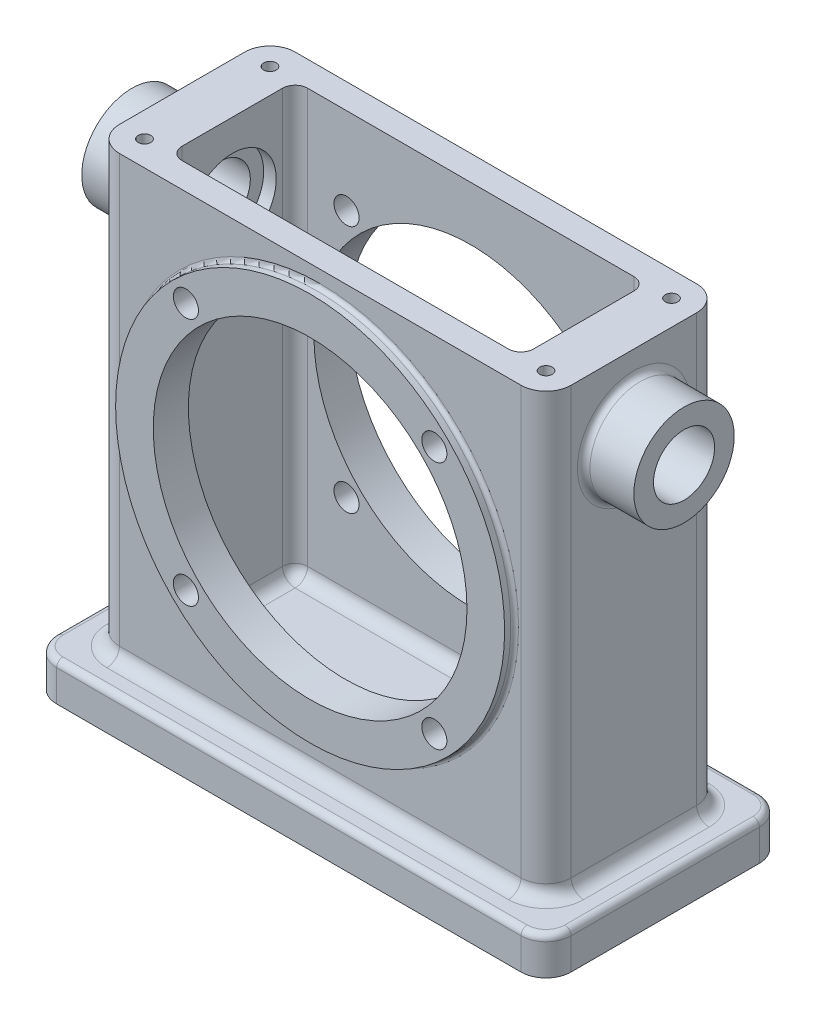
from build123d import *

# Parameters (mm, degrees)
SKETCH1_W           = 130.175
SKETCH1_H           = 60.325
BASE_EXTRUDE_DEPTH  = 9.525
SKETCH2_W           = 114.3
SKETCH2_H           = 44.45
BOSS_EXTRUDE1_DEPTH = 111.125
FILLET1_R           = 6.35
FILLET2_R           = 1.5875
FILLET3_R           = 3.175
CUT_EXTRUDE1_DEPTH  = 107.95
FILLET4_R           = 3.175
SKETCH4_R           = 49.2125
BOSS_EXTRUDE2_DEPTH = 2.54
SKETCH5_R           = 39.6875
CUT_EXTRUDE2_DEPTH  = 148.681533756
FILLET5_R           = 0.9906
SKETCH6_R           = 12.7
BOSS_EXTRUDE3_DEPTH = 12.7
SKETCH7_R           = 7.7343
CUT_EXTRUDE3_DEPTH  = 166.724659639
SKETCH8_R           = 11.1125
CUT_EXTRUDE4_DEPTH  = 3.175
FILLET6_R           = 1.5875
SKETCH9_R           = 3.175
CUT_EXTRUDE5_DEPTH  = 150.841500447
CIRPATTERN1_COUNT   = 4
SKETCH10_R          = 1.5875
CUT_EXTRUDE6_DEPTH  = 19.05


with BuildPart() as part:
    # Sketch1 → Base-Extrude (new body)
    with BuildSketch(Plane(origin=(0, 0, 0), x_dir=(1, 0, 0), z_dir=(0, 1, 0))):
        Rectangle(SKETCH1_W, SKETCH1_H)
    extrude(amount=BASE_EXTRUDE_DEPTH)

    # Sketch2 → Boss-Extrude1 (add)
    with BuildSketch(Plane(origin=(0, 9.525, 0), x_dir=(-1, 0, 0), z_dir=(0, 1, 0))):
        Rectangle(SKETCH2_W, SKETCH2_H)
    extrude(amount=BOSS_EXTRUDE1_DEPTH)

    # Fillet1
    fillet1_edges = [part.edges().sort_by_distance(p)[0] for p in [
        (-57.15, 65.0875, -22.225),
        (-57.15, 65.0875, 22.225),
        (57.15, 65.0875, 22.225),
        (57.15, 65.0875, -22.225),
        (-65.0875, 4.7625, -30.1625),
        (65.0875, 4.7625, -30.1625),
        (65.0875, 4.7625, 30.1625),
        (-65.0875, 4.7625, 30.1625),
    ]]
    fillet(fillet1_edges, radius=FILLET1_R)

    # Fillet2
    fillet2_edges = [part.edges().sort_by_distance(p)[0] for p in [
        (0, 9.525, 30.1625),
        (-65.0875, 9.525, 0),
        (65.0875, 9.525, 0),
        (0, 9.525, -30.1625),
        (-63.227628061, 9.525, -28.302628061),
        (63.227628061, 9.525, 28.302628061),
        (63.227628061, 9.525, -28.302628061),
        (-63.227628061, 9.525, 28.302628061),
    ]]
    fillet(fillet2_edges, radius=FILLET2_R)

    # Fillet3
    fillet3_edges = [part.edges().sort_by_distance(p)[0] for p in [
        (-57.15, 9.525, 0),
        (0, 9.525, -22.225),
        (57.15, 9.525, 0),
        (0, 9.525, 22.225),
        (-55.290128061, 9.525, 20.365128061),
        (-55.290128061, 9.525, -20.365128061),
        (55.290128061, 9.525, 20.365128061),
        (55.290128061, 9.525, -20.365128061),
    ]]
    fillet(fillet3_edges, radius=FILLET3_R)

    # Sketch3 → Cut-Extrude1 (cut)
    with BuildSketch(Plane(origin=(0, 120.65, 0), x_dir=(-1, 0, 0), z_dir=(0, 1, 0))):
        with BuildLine():
            Line((41.275, 15.875), (-41.275, 15.875))
            ThreePointArc((-41.275, 15.875), (-43.52006403, 14.94506403), (-44.45, 12.7))
            Line((-44.45, 12.7), (-44.45, -12.7))
            ThreePointArc((-44.45, -12.7), (-43.52006403, -14.94506403), (-41.275, -15.875))
            Line((-41.275, -15.875), (41.275, -15.875))
            ThreePointArc((41.275, -15.875), (43.52006403, -14.94506403), (44.45, -12.7))
            Line((44.45, -12.7), (44.45, 12.7))
            ThreePointArc((44.45, 12.7), (43.52006403, 14.94506403), (41.275, 15.875))
        make_face()
    extrude(amount=-CUT_EXTRUDE1_DEPTH, mode=Mode.SUBTRACT)

    # Fillet4
    fillet4_edges = [part.edges().sort_by_distance(p)[0] for p in [
        (43.52006403, 12.7, 14.94506403),
        (0, 12.7, 15.875),
        (-43.52006403, 12.7, 14.94506403),
        (-44.45, 12.7, 0),
        (-43.52006403, 12.7, -14.94506403),
        (0, 12.7, -15.875),
        (43.52006403, 12.7, -14.94506403),
        (44.45, 12.7, 0),
    ]]
    fillet(fillet4_edges, radius=FILLET4_R)

    # Sketch4 → Boss-Extrude2 (add)
    with BuildSketch(Plane.XY.offset(22.225)):
        with Locations(Location((0, 67.31, 0), (0, 0, 180))):
            Circle(SKETCH4_R)
    boss_extrude2 = extrude(amount=BOSS_EXTRUDE2_DEPTH)

    # Mirror1: Boss-Extrude2 across plane
    add(boss_extrude2.mirror(Plane.XY))

    # Sketch5 → Cut-Extrude2 (cut, through all)
    with BuildSketch(Plane.XY.offset(24.765)):
        with Locations(Location((0, 67.31, 0), (0, 0, 180))):
            Circle(SKETCH5_R)
    extrude(amount=-CUT_EXTRUDE2_DEPTH, mode=Mode.SUBTRACT)

    # Fillet5
    fillet5_edges = [part.edges().sort_by_distance(p)[0] for p in [
        (49.2125, 67.31, 22.225),
        (49.2125, 67.31, -22.225),
    ]]
    fillet(fillet5_edges, radius=FILLET5_R)

    # Sketch6 → Boss-Extrude3 (add)
    with BuildSketch(Plane(origin=(57.15, 0, 0), x_dir=(0, 0, -1), z_dir=(1, 0, 0))):
        with Locations(Location((0, 101.6, 0), (0, 0, 180))):
            Circle(SKETCH6_R)
    boss_extrude3 = extrude(amount=BOSS_EXTRUDE3_DEPTH)

    # Sketch7 → Cut-Extrude3 (cut, through all)
    with BuildSketch(Plane.ZY.offset(-44.45)):
        with Locations((0, 101.6)):
            Circle(SKETCH7_R)
    cut_extrude3 = extrude(amount=-CUT_EXTRUDE3_DEPTH, mode=Mode.SUBTRACT)

    # Sketch8 → Cut-Extrude4 (cut)
    with BuildSketch(Plane.ZY.offset(-44.45)):
        with Locations((0, 101.6)):
            Circle(SKETCH8_R)
    cut_extrude4 = extrude(amount=-CUT_EXTRUDE4_DEPTH, mode=Mode.SUBTRACT)

    # Mirror3: Boss-Extrude3, Cut-Extrude3, Cut-Extrude4 across plane
    add(boss_extrude3.mirror(Plane(origin=(0, 0, 0), x_dir=(0, 0, 1), z_dir=(1, 0, 0))))
    add(cut_extrude3.mirror(Plane(origin=(0, 0, 0), x_dir=(0, 0, 1), z_dir=(1, 0, 0))), mode=Mode.SUBTRACT)
    add(cut_extrude4.mirror(Plane(origin=(0, 0, 0), x_dir=(0, 0, 1), z_dir=(1, 0, 0))), mode=Mode.SUBTRACT)

    # Fillet6
    fillet6_edges = [part.edges().sort_by_distance(p)[0] for p in [
        (57.15, 101.6, -12.7),
        (-57.15, 101.6, -12.7),
    ]]
    fillet(fillet6_edges, radius=FILLET6_R)

    # Sketch9 → Cut-Extrude5 (cut, through all)
    with BuildSketch(Plane.XY.offset(24.765)):
        with Locations(Location((31.430896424, 98.740896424, 0), (0, 0, 180))):
            Circle(SKETCH9_R)
    cut_extrude5 = extrude(amount=-CUT_EXTRUDE5_DEPTH, mode=Mode.SUBTRACT)

    # CirPattern1: Cut-Extrude5 ×4 about axis
    cirpattern1_axis = Axis((0, 67.31, 0), (0, 0, 1))
    for i in range(1, CIRPATTERN1_COUNT):
        add(cut_extrude5.rotate(cirpattern1_axis, i * 360 / CIRPATTERN1_COUNT), mode=Mode.SUBTRACT)

    # Sketch10 → Cut-Extrude6 (cut)
    with BuildSketch(Plane(origin=(0, 120.65, 0), x_dir=(-1, 0, 0), z_dir=(0, 1, 0))):
        with Locations(Location((-50.8, -15.875, 0), (0, 0, 90))):
            Circle(SKETCH10_R)
        with Locations(Location((-50.8, 15.875, 0), (0, 0, 90))):
            Circle(SKETCH10_R)
    cut_extrude6 = extrude(amount=-CUT_EXTRUDE6_DEPTH, mode=Mode.SUBTRACT)

    # Mirror4: Cut-Extrude6 across plane
    add(cut_extrude6.mirror(Plane(origin=(0, 0, 0), x_dir=(0, 0, 1), z_dir=(1, 0, 0))), mode=Mode.SUBTRACT)


solid = part.part
